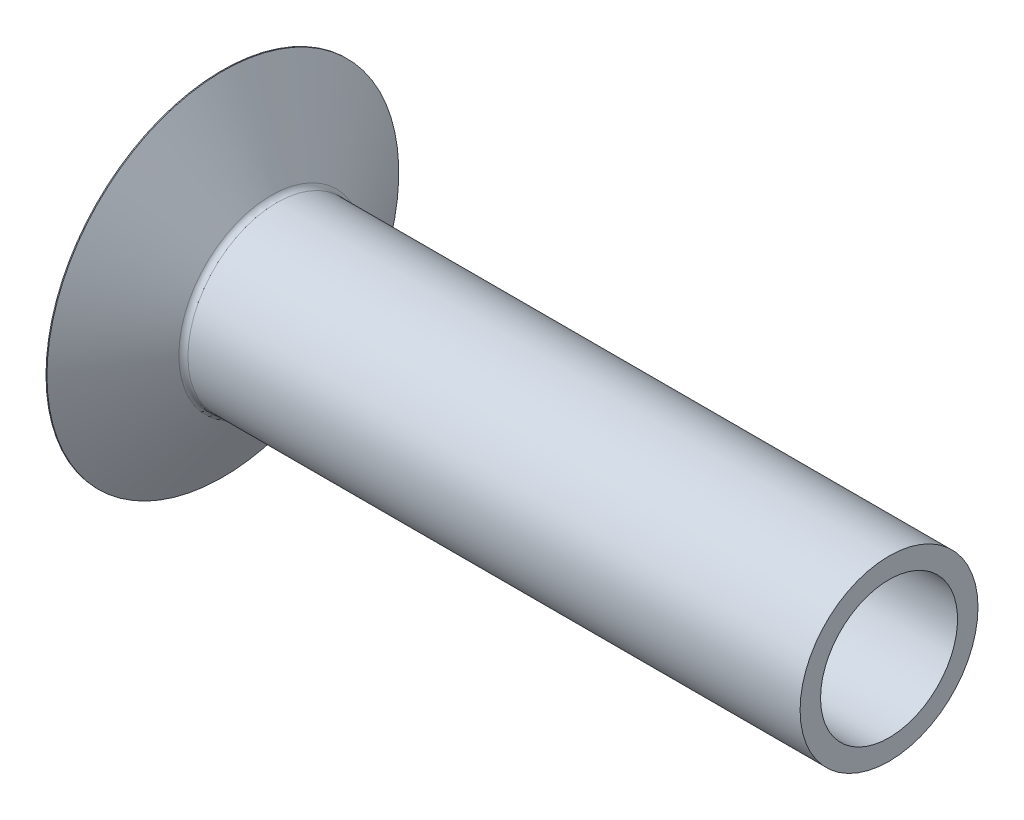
from build123d import *


with BuildPart() as part:
    # Sketch1 → Base-Revolve (revolve)
    with BuildSketch(Plane.XY, mode=Mode.PRIVATE) as base_revolve_sk:
        with BuildLine():
            Line((30, 0), (30, 4))
            Line((30, 4), (2.473205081, 4))
            ThreePointArc((2.473205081, 4), (2.323205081, 4.040192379), (2.21339746, 4.15))
            Line((2.21339746, 4.15), (0.042560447, 7.91))
            Line((0.042560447, 7.91), (0, 7.91))
            Line((0, 7.91), (0, 0))
            Line((0, 0), (30, 0))
        make_face()
    revolve(base_revolve_sk.sketch.rotate(Axis((-55.411731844, 0, 0), (1, 0, 0)), 90), axis=Axis((-55.411731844, 0, 0), (1, 0, 0)))

    # Sketch3 → Cut-Revolve1 (revolve, cut)
    with BuildSketch(Plane.XY, mode=Mode.PRIVATE) as cut_revolve1_sk:
        Polygon((30, 3.08), (21.65, 3.08), (19.871761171, 0), (30, 0), align=None)
    revolve(cut_revolve1_sk.sketch.rotate(Axis((-6.108007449, 0, 0), (1, 0, 0)), 270), axis=Axis((-6.108007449, 0, 0), (1, 0, 0)), mode=Mode.SUBTRACT)


solid = part.part
